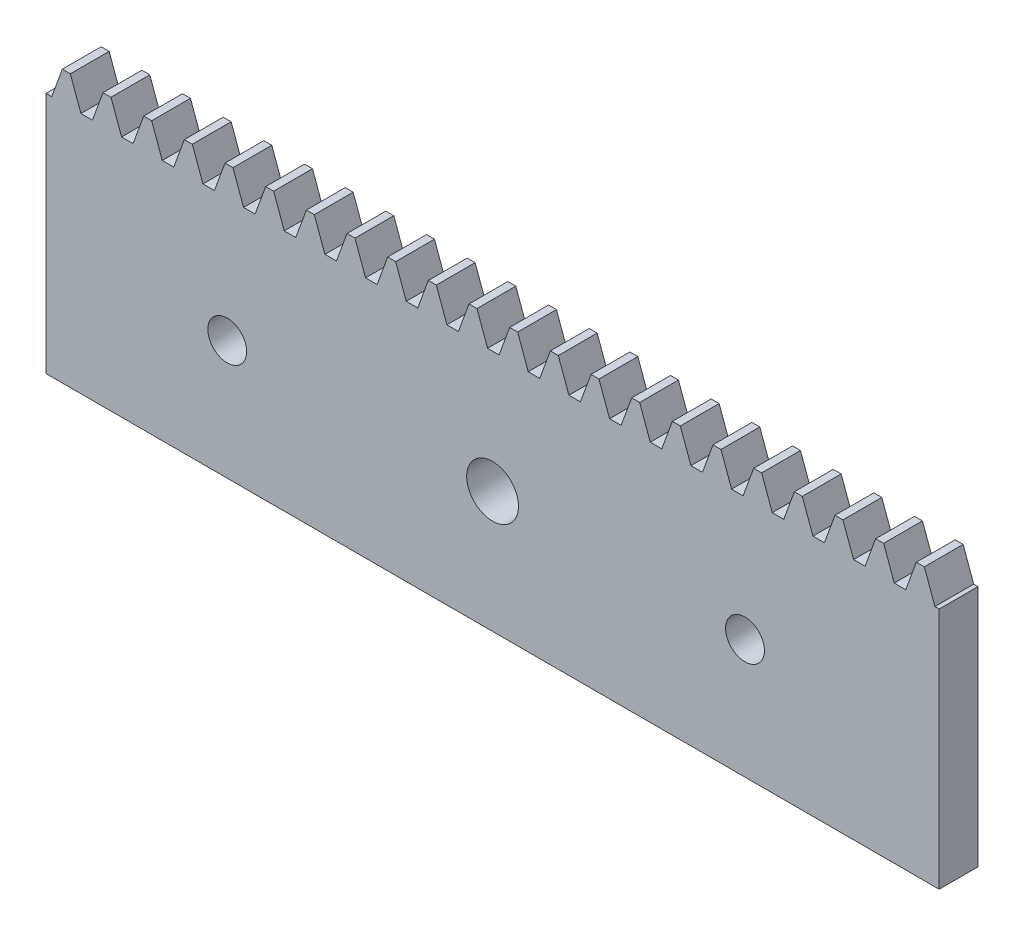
from build123d import *

# Parameters (mm, degrees)
BLANKSKE_W         = 69
BLANKSKE_H         = 21
BLANK_DEPTH        = 3
TOOTHCUTSIM_DEPTH  = 73.187256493
TEETHCUTS_COUNT    = 23
TEETHCUTS_PITCH    = 3.14159265
CUT_EXTRUDE1_REACH = 74.187
SKETCH1_R          = 1.5
CUT_EXTRUDE2_REACH = 74.187
SKETCH2_R          = 2


with BuildPart() as part:
    # BlankSke → Blank (new body)
    with BuildSketch(Plane.XY):
        with Locations((34.5, 10.5)):
            Rectangle(BLANKSKE_W, BLANKSKE_H)
    extrude(amount=-BLANK_DEPTH)

    # TooCutSkeSim → ToothCutSim (cut, through all)
    with BuildSketch(Plane.XY):
        Polygon((0.44443537, 18.75), (-0.44443537, 18.75), (-1.272613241, 21.0254), (1.272613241, 21.0254), align=None)
    toothcutsim = extrude(amount=-TOOTHCUTSIM_DEPTH, mode=Mode.SUBTRACT)

    # TeethCuts: ToothCutSim ×23
    with Locations(*[(i * TEETHCUTS_PITCH, 0, 0) for i in range(1, TEETHCUTS_COUNT)]):
        add(toothcutsim, mode=Mode.SUBTRACT)

    # Sketch1 → Cut-Extrude1 (cut, up to next)
    with BuildSketch(Plane.XY, mode=Mode.PRIVATE) as cut_extrude1_sk1:
        with Locations((14, 9.216013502)):
            Circle(SKETCH1_R)
    cut_extrude1_tool1 = extrude(cut_extrude1_sk1.sketch, amount=-CUT_EXTRUDE1_REACH, mode=Mode.PRIVATE) & part.part
    # Sketch1 → Cut-Extrude1 (cut, up to next)
    with BuildSketch(Plane.XY, mode=Mode.PRIVATE) as cut_extrude1_sk2:
        with Locations((54, 9.216013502)):
            Circle(SKETCH1_R)
    cut_extrude1_tool2 = extrude(cut_extrude1_sk2.sketch, amount=-CUT_EXTRUDE1_REACH, mode=Mode.PRIVATE) & part.part
    add(cut_extrude1_tool1.solids().sort_by_distance((14, 9.216014, 0))[0], mode=Mode.SUBTRACT)
    add(cut_extrude1_tool2.solids().sort_by_distance((54, 9.216014, 0))[0], mode=Mode.SUBTRACT)

    # Sketch2 → Cut-Extrude2 (cut, up to next)
    with BuildSketch(Plane.XY, mode=Mode.PRIVATE) as cut_extrude2_sk1:
        with Locations((34.5, 9.375)):
            Circle(SKETCH2_R)
    cut_extrude2_tool1 = extrude(cut_extrude2_sk1.sketch, amount=-CUT_EXTRUDE2_REACH, mode=Mode.PRIVATE) & part.part
    add(cut_extrude2_tool1.solids().sort_by_distance((34.5, 9.375, 0))[0], mode=Mode.SUBTRACT)


solid = part.part
